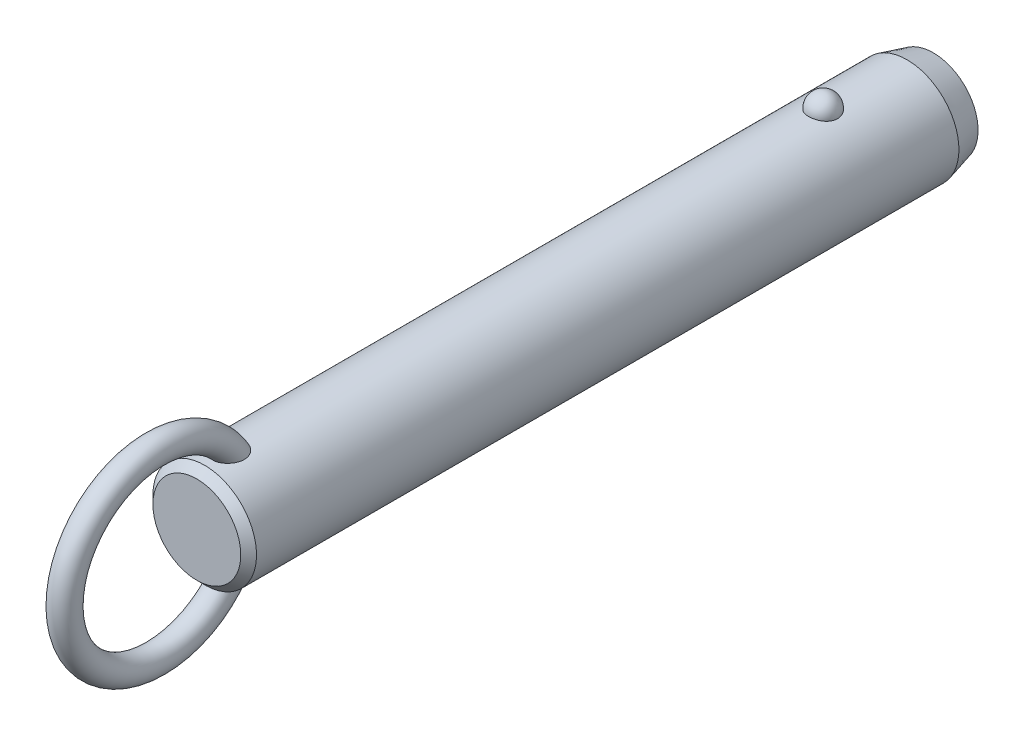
ISO-10303-21;
HEADER;
FILE_DESCRIPTION(('STEP AP214'),'2;1');
FILE_NAME('part.step','',(''),(''),'','','');
FILE_SCHEMA(('AUTOMOTIVE_DESIGN { 1 0 10303 214 1 1 1 1 }'));
ENDSEC;
DATA;
#1=APPLICATION_CONTEXT('core data for automotive mechanical design processes');
#2=APPLICATION_PROTOCOL_DEFINITION('international standard','automotive_design',2000,#1);
#3=PRODUCT_CONTEXT('',#1,'mechanical');
#4=PRODUCT('Part','Part','',(#3));
#5=PRODUCT_RELATED_PRODUCT_CATEGORY('part','',(#4));
#6=PRODUCT_DEFINITION_FORMATION('','',#4);
#7=PRODUCT_DEFINITION_CONTEXT('part definition',#1,'design');
#8=PRODUCT_DEFINITION('design','',#6,#7);
#9=PRODUCT_DEFINITION_SHAPE('','',#8);
#10=(LENGTH_UNIT() NAMED_UNIT(*) SI_UNIT(.MILLI.,.METRE.));
#11=(NAMED_UNIT(*) PLANE_ANGLE_UNIT() SI_UNIT($,.RADIAN.));
#12=(NAMED_UNIT(*) SI_UNIT($,.STERADIAN.) SOLID_ANGLE_UNIT());
#13=UNCERTAINTY_MEASURE_WITH_UNIT(LENGTH_MEASURE(1.E-05),#10,'distance_accuracy_value','');
#14=(GEOMETRIC_REPRESENTATION_CONTEXT(3) GLOBAL_UNCERTAINTY_ASSIGNED_CONTEXT((#13)) GLOBAL_UNIT_ASSIGNED_CONTEXT((#10,
#11,#12)) REPRESENTATION_CONTEXT('',''));
#15=CARTESIAN_POINT('',(0.,0.,0.));
#16=DIRECTION('',(0.,0.,1.));
#17=DIRECTION('',(1.,0.,0.));
#18=AXIS2_PLACEMENT_3D('',#15,#16,#17);
#19=CARTESIAN_POINT('',(0.,0.,83.8));
#20=DIRECTION('',(0.,0.,-1.));
#21=DIRECTION('',(-1.,0.,0.));
#22=AXIS2_PLACEMENT_3D('',#19,#20,#21);
#23=CYLINDRICAL_SURFACE('',#22,7.9);
#24=CARTESIAN_POINT('',(2.1785689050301,7.59367088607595,-2.19999999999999));
#25=CARTESIAN_POINT('',(2.17856679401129,7.59367269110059,-2.07701843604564));
#26=CARTESIAN_POINT('',(2.16853481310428,7.59657145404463,-1.95401006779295));
#27=CARTESIAN_POINT('',(2.12864689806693,7.607843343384,-1.71147811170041));
#28=CARTESIAN_POINT('',(2.09878338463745,7.61621856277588,-1.59195587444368));
#29=CARTESIAN_POINT('',(2.0199931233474,7.63749180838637,-1.3598563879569));
#30=CARTESIAN_POINT('',(1.97107475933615,7.6503878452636,-1.24727610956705));
#31=CARTESIAN_POINT('',(1.85539377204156,7.67926115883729,-1.03213234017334));
#32=CARTESIAN_POINT('',(1.78863158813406,7.69523835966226,-0.929568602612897));
#33=CARTESIAN_POINT('',(1.63856494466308,7.7285848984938,-0.736786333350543));
#34=CARTESIAN_POINT('',(1.55518140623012,7.7459606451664,-0.646630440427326));
#35=CARTESIAN_POINT('',(1.37422937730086,7.78009978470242,-0.481747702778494));
#36=CARTESIAN_POINT('',(1.27666086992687,7.79686317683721,-0.407020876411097));
#37=CARTESIAN_POINT('',(1.07024728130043,7.82786153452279,-0.275278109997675));
#38=CARTESIAN_POINT('',(0.961434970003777,7.84210353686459,-0.218212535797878));
#39=CARTESIAN_POINT('',(0.735351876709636,7.86652194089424,-0.123146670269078));
#40=CARTESIAN_POINT('',(0.618082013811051,7.87669878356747,-0.085144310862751));
#41=CARTESIAN_POINT('',(0.380637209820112,7.89170521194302,-0.0298158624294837));
#42=CARTESIAN_POINT('',(0.260550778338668,7.89662650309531,-0.0121347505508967));
#43=CARTESIAN_POINT('',(0.0190117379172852,7.90090003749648,0.00324379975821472));
#44=CARTESIAN_POINT('',(-0.102440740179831,7.90025280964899,0.00094313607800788));
#45=CARTESIAN_POINT('',(-0.341452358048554,7.89351056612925,-0.0233955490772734));
#46=CARTESIAN_POINT('',(-0.459042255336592,7.88749257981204,-0.0451545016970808));
#47=CARTESIAN_POINT('',(-0.688796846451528,7.87075812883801,-0.107408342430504));
#48=CARTESIAN_POINT('',(-0.800961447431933,7.86004158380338,-0.147903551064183));
#49=CARTESIAN_POINT('',(-1.01743634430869,7.83497131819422,-0.246799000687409));
#50=CARTESIAN_POINT('',(-1.12169791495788,7.82059709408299,-0.305300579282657));
#51=CARTESIAN_POINT('',(-1.31891765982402,7.78976470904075,-0.438549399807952));
#52=CARTESIAN_POINT('',(-1.41187469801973,7.77330633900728,-0.513298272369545));
#53=CARTESIAN_POINT('',(-1.58577142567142,7.73972434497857,-0.678622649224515));
#54=CARTESIAN_POINT('',(-1.66645140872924,7.72259402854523,-0.769470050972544));
#55=CARTESIAN_POINT('',(-1.81161503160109,7.68983776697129,-0.963538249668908));
#56=CARTESIAN_POINT('',(-1.87609753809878,7.6742119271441,-1.06675991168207));
#57=CARTESIAN_POINT('',(-1.98790138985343,7.6460202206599,-1.28401170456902));
#58=CARTESIAN_POINT('',(-2.03501994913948,7.63349104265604,-1.39815107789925));
#59=CARTESIAN_POINT('',(-2.10986724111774,7.6131449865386,-1.63301784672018));
#60=CARTESIAN_POINT('',(-2.1375965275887,7.60532797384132,-1.75374505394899));
#61=CARTESIAN_POINT('',(-2.17289256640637,7.5953195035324,-1.99782562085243));
#62=CARTESIAN_POINT('',(-2.18054294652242,7.59310471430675,-2.12116592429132));
#63=CARTESIAN_POINT('',(-2.17572919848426,7.59448538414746,-2.36741799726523));
#64=CARTESIAN_POINT('',(-2.1632656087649,7.59808068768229,-2.49032977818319));
#65=CARTESIAN_POINT('',(-2.11865035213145,7.61064035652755,-2.73161015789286));
#66=CARTESIAN_POINT('',(-2.08659579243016,7.61957823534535,-2.84999812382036));
#67=CARTESIAN_POINT('',(-2.00367799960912,7.64179982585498,-3.07955956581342));
#68=CARTESIAN_POINT('',(-1.9528140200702,7.65508371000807,-3.19073275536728));
#69=CARTESIAN_POINT('',(-1.83321113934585,7.68460381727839,-3.40337899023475));
#70=CARTESIAN_POINT('',(-1.76437735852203,7.70085556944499,-3.50479651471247));
#71=CARTESIAN_POINT('',(-1.61069526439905,7.73445734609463,-3.69446912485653));
#72=CARTESIAN_POINT('',(-1.52584634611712,7.75180741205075,-3.78272371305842));
#73=CARTESIAN_POINT('',(-1.34198059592,7.78574608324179,-3.94393987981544));
#74=CARTESIAN_POINT('',(-1.24291308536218,7.80233167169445,-4.01684434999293));
#75=CARTESIAN_POINT('',(-1.03352039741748,7.83281625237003,-4.14489386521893));
#76=CARTESIAN_POINT('',(-0.92319600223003,7.84671543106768,-4.20004014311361));
#77=CARTESIAN_POINT('',(-0.695822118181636,7.87011575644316,-4.29042017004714));
#78=CARTESIAN_POINT('',(-0.578872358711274,7.87966903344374,-4.32589112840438));
#79=CARTESIAN_POINT('',(-0.340410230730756,7.8935652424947,-4.37692226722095));
#80=CARTESIAN_POINT('',(-0.218898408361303,7.89790879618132,-4.39248482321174));
#81=CARTESIAN_POINT('',(0.0228107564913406,7.90087453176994,-4.40314405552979));
#82=CARTESIAN_POINT('',(0.142990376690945,7.89960185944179,-4.39861683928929));
#83=CARTESIAN_POINT('',(0.380829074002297,7.89171262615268,-4.37008293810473));
#84=CARTESIAN_POINT('',(0.498488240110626,7.8850962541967,-4.34607694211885));
#85=CARTESIAN_POINT('',(0.727535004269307,7.86726442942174,-4.27939317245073));
#86=CARTESIAN_POINT('',(0.838944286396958,7.85606616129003,-4.236785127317));
#87=CARTESIAN_POINT('',(1.05295421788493,7.83025654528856,-4.13408348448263));
#88=CARTESIAN_POINT('',(1.15555431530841,7.81564498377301,-4.07398879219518));
#89=CARTESIAN_POINT('',(1.35076763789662,7.7843022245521,-3.93687432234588));
#90=CARTESIAN_POINT('',(1.4432046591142,7.76754209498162,-3.85961036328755));
#91=CARTESIAN_POINT('',(1.6139111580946,7.73387857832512,-3.69076949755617));
#92=CARTESIAN_POINT('',(1.6921781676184,7.71697516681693,-3.59919010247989));
#93=CARTESIAN_POINT('',(1.83380875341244,7.6845643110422,-3.40247278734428));
#94=CARTESIAN_POINT('',(1.89689280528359,7.66908588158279,-3.29712873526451));
#95=CARTESIAN_POINT('',(2.0047823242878,7.64159441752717,-3.07707931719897));
#96=CARTESIAN_POINT('',(2.0495945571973,7.62958010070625,-2.96237743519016));
#97=CARTESIAN_POINT('',(2.11580183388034,7.61146617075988,-2.74040519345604));
#98=CARTESIAN_POINT('',(2.13929812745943,7.60484503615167,-2.63379846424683));
#99=CARTESIAN_POINT('',(2.17068242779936,7.59594664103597,-2.41813481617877));
#100=CARTESIAN_POINT('',(2.17857077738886,7.59366928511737,-2.30907795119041));
#101=CARTESIAN_POINT('',(2.1785689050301,7.59367088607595,-2.19999999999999));
#102=B_SPLINE_CURVE_WITH_KNOTS('',3,(#24,#25,#26,#27,#28,#29,#30,#31,#32,#33,#34,#35,#36,#37,
#38,#39,#40,#41,#42,#43,#44,#45,#46,#47,#48,#49,#50,#51,#52,#53,#54,#55,#56,#57,#58,#59,#60,#61,
#62,#63,#64,#65,#66,#67,#68,#69,#70,#71,#72,#73,#74,#75,#76,#77,#78,#79,#80,#81,#82,#83,#84,#85,
#86,#87,#88,#89,#90,#91,#92,#93,#94,#95,#96,#97,#98,#99,#100,#101),.UNSPECIFIED.,.T.,.F.,(4,2,2,
2,2,2,2,2,2,2,2,2,2,2,2,2,2,2,2,2,2,2,2,2,2,2,2,2,2,2,2,2,2,2,2,2,2,2,4),(0.,0.368552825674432,
0.737246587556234,1.10577831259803,1.4743009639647,1.8446206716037,2.21494081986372,
2.5842105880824,2.95344028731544,3.31611630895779,3.67875788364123,4.03628044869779,
4.39380913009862,4.75338791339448,5.11300280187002,5.47939989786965,5.8458226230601,
6.21639834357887,6.58696347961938,6.95598276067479,7.32499216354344,7.69218715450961,
8.0593967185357,8.42858578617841,8.79778880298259,9.16834203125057,9.5388695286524,
9.90482699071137,10.2707407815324,10.6298333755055,10.9889132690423,11.3466585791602,
11.7044262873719,12.0676511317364,12.4309391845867,12.8004764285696,13.1698767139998,
13.4967701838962,13.8236564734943),.UNSPECIFIED.);
#103=CARTESIAN_POINT('',(2.1785689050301,7.59367088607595,-2.19999999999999));
#104=VERTEX_POINT('',#103);
#105=EDGE_CURVE('E41',#104,#104,#102,.T.);
#106=ORIENTED_EDGE('',*,*,#105,.T.);
#107=EDGE_LOOP('',(#106));
#108=FACE_BOUND('',#107,.T.);
#109=CARTESIAN_POINT('',(0.,0.,92.12));
#110=DIRECTION('',(0.,0.,1.));
#111=DIRECTION('',(1.,0.,0.));
#112=AXIS2_PLACEMENT_3D('',#109,#110,#111);
#113=CIRCLE('',#112,7.9);
#114=CARTESIAN_POINT('',(-7.90000000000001,0.,92.12));
#115=VERTEX_POINT('',#114);
#116=EDGE_CURVE('E10',#115,#115,#113,.F.);
#117=ORIENTED_EDGE('',*,*,#116,.T.);
#118=EDGE_LOOP('',(#117));
#119=FACE_BOUND('',#118,.T.);
#120=CARTESIAN_POINT('',(-0.630969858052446,-7.87476203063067,86.0124322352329));
#121=CARTESIAN_POINT('',(-0.734180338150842,-7.8664899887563,86.047285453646));
#122=CARTESIAN_POINT('',(-0.834476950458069,-7.85639291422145,86.0908160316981));
#123=CARTESIAN_POINT('',(-1.0262035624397,-7.83366343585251,86.194094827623));
#124=CARTESIAN_POINT('',(-1.1176141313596,-7.82102565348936,86.2538775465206));
#125=CARTESIAN_POINT('',(-1.28877277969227,-7.79464922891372,86.3878390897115));
#126=CARTESIAN_POINT('',(-1.36854014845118,-7.78091246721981,86.461993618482));
#127=CARTESIAN_POINT('',(-1.5146152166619,-7.75380398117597,86.6224941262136));
#128=CARTESIAN_POINT('',(-1.58092966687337,-7.74043207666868,86.7088339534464));
#129=CARTESIAN_POINT('',(-1.70019064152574,-7.71512522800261,86.8929784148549));
#130=CARTESIAN_POINT('',(-1.75284037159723,-7.70322473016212,86.9909792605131));
#131=CARTESIAN_POINT('',(-1.84263464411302,-7.68224112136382,87.1941029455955));
#132=CARTESIAN_POINT('',(-1.87977299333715,-7.6731591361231,87.2992286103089));
#133=CARTESIAN_POINT('',(-1.94152728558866,-7.65777930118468,87.5232849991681));
#134=CARTESIAN_POINT('',(-1.96475471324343,-7.65179654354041,87.6426167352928));
#135=CARTESIAN_POINT('',(-1.99449499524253,-7.64409642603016,87.8834298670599));
#136=CARTESIAN_POINT('',(-2.0010005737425,-7.64238092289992,88.0049121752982));
#137=CARTESIAN_POINT('',(-1.99856014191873,-7.64302120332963,88.2683409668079));
#138=CARTESIAN_POINT('',(-1.98680021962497,-7.64611845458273,88.4102565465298));
#139=CARTESIAN_POINT('',(-1.94457772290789,-7.65696186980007,88.6911188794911));
#140=CARTESIAN_POINT('',(-1.91409393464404,-7.66471330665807,88.8300620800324));
#141=CARTESIAN_POINT('',(-1.82768670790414,-7.68582947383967,89.1319397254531));
#142=CARTESIAN_POINT('',(-1.76772963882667,-7.70003779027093,89.293686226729));
#143=CARTESIAN_POINT('',(-1.65998501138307,-7.72371550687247,89.5276956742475));
#144=CARTESIAN_POINT('',(-1.621079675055,-7.73200670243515,89.6042974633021));
#145=CARTESIAN_POINT('',(-1.53727726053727,-7.74910377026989,89.7540798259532));
#146=CARTESIAN_POINT('',(-1.49238215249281,-7.75790947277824,89.8272615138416));
#147=CARTESIAN_POINT('',(-1.3739705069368,-7.77993338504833,90.0028838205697));
#148=CARTESIAN_POINT('',(-1.29690364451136,-7.79328473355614,90.1029557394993));
#149=CARTESIAN_POINT('',(-1.12885487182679,-7.81939266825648,90.2907147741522));
#150=CARTESIAN_POINT('',(-1.03789926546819,-7.83215032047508,90.3784247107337));
#151=CARTESIAN_POINT('',(-0.869532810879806,-7.85231710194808,90.5134148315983));
#152=CARTESIAN_POINT('',(-0.795716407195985,-7.86021093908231,90.565076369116));
#153=CARTESIAN_POINT('',(-0.64081313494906,-7.87434920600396,90.6563815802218));
#154=CARTESIAN_POINT('',(-0.55973779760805,-7.88059619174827,90.6960438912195));
#155=CARTESIAN_POINT('',(-0.406456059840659,-7.88984116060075,90.7543008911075));
#156=CARTESIAN_POINT('',(-0.335227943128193,-7.89321892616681,90.7753848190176));
#157=CARTESIAN_POINT('',(-0.190193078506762,-7.89804235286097,90.8054141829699));
#158=CARTESIAN_POINT('',(-0.116388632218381,-7.89948969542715,90.8143701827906));
#159=CARTESIAN_POINT('',(0.0318414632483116,-7.90028409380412,90.8192915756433));
#160=CARTESIAN_POINT('',(0.10626813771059,-7.89962640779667,90.8152276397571));
#161=CARTESIAN_POINT('',(0.253290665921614,-7.8962818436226,90.7944615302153));
#162=CARTESIAN_POINT('',(0.32588518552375,-7.8935935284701,90.7777504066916));
#163=CARTESIAN_POINT('',(0.481441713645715,-7.88577340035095,90.7287380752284));
#164=CARTESIAN_POINT('',(0.563611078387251,-7.88026321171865,90.694005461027));
#165=CARTESIAN_POINT('',(0.721129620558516,-7.86741729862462,90.6117965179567));
#166=CARTESIAN_POINT('',(0.796466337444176,-7.86007832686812,90.5642975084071));
#167=CARTESIAN_POINT('',(0.971456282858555,-7.84073285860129,90.436513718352));
#168=CARTESIAN_POINT('',(1.06719686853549,-7.82809461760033,90.3510047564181));
#169=CARTESIAN_POINT('',(1.24418921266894,-7.80192439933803,90.166232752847));
#170=CARTESIAN_POINT('',(1.32540832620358,-7.78839049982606,90.0669395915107));
#171=CARTESIAN_POINT('',(1.45199971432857,-7.76559693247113,89.8895760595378));
#172=CARTESIAN_POINT('',(1.5008564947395,-7.75626094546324,89.8139542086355));
#173=CARTESIAN_POINT('',(1.59197749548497,-7.7380727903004,89.6587428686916));
#174=CARTESIAN_POINT('',(1.63423919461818,-7.72922080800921,89.5791518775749));
#175=CARTESIAN_POINT('',(1.71222612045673,-7.71231959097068,89.4166640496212));
#176=CARTESIAN_POINT('',(1.74794516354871,-7.70427111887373,89.3337641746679));
#177=CARTESIAN_POINT('',(1.81270113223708,-7.68929240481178,89.1652967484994));
#178=CARTESIAN_POINT('',(1.84173789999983,-7.68236218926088,89.0797291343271));
#179=CARTESIAN_POINT('',(1.89322698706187,-7.66983757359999,88.9052870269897));
#180=CARTESIAN_POINT('',(1.91558744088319,-7.66426199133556,88.8163838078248));
#181=CARTESIAN_POINT('',(1.95281367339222,-7.65485915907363,88.6369696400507));
#182=CARTESIAN_POINT('',(1.96767946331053,-7.65103190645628,88.5464586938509));
#183=CARTESIAN_POINT('',(2.00021456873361,-7.64262981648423,88.2737320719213));
#184=CARTESIAN_POINT('',(2.00600691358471,-7.6410871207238,88.0897099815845));
#185=CARTESIAN_POINT('',(1.98445334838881,-7.64669564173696,87.7765019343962));
#186=CARTESIAN_POINT('',(1.96607186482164,-7.65149688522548,87.6466189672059));
#187=CARTESIAN_POINT('',(1.90884967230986,-7.6659762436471,87.3916321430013));
#188=CARTESIAN_POINT('',(1.8700210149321,-7.67565148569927,87.266525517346));
#189=CARTESIAN_POINT('',(1.77063986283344,-7.69918471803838,87.0245401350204));
#190=CARTESIAN_POINT('',(1.70993724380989,-7.71307150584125,86.9077250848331));
#191=CARTESIAN_POINT('',(1.56733070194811,-7.74330306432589,86.6881444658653));
#192=CARTESIAN_POINT('',(1.4854369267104,-7.75964665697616,86.5853722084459));
#193=CARTESIAN_POINT('',(1.31346177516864,-7.79047523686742,86.4093800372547));
#194=CARTESIAN_POINT('',(1.22547278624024,-7.80495298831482,86.3341066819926));
#195=CARTESIAN_POINT('',(1.03724352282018,-7.83218597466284,86.2004864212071));
#196=CARTESIAN_POINT('',(0.937008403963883,-7.84494192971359,86.1421324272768));
#197=CARTESIAN_POINT('',(0.733599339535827,-7.86649045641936,86.0470270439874));
#198=CARTESIAN_POINT('',(0.630941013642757,-7.87547134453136,86.0092109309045));
#199=CARTESIAN_POINT('',(0.420465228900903,-7.88950708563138,85.9511160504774));
#200=CARTESIAN_POINT('',(0.312645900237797,-7.89456050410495,85.9308436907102));
#201=CARTESIAN_POINT('',(0.0960869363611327,-7.9001518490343,85.9084559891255));
#202=CARTESIAN_POINT('',(-0.0126341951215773,-7.90073226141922,85.9061698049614));
#203=CARTESIAN_POINT('',(-0.228766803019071,-7.89742350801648,85.9193678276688));
#204=CARTESIAN_POINT('',(-0.336180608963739,-7.89354403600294,85.9348134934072));
#205=CARTESIAN_POINT('',(-0.473410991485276,-7.88586871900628,85.9662177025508));
#206=CARTESIAN_POINT('',(-0.50525779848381,-7.88388984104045,85.9743541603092));
#207=CARTESIAN_POINT('',(-0.5684812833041,-7.87958326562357,85.9922083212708));
#208=CARTESIAN_POINT('',(-0.599857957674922,-7.87725556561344,86.0019260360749));
#209=CARTESIAN_POINT('',(-0.630969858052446,-7.87476203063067,86.0124322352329));
#210=B_SPLINE_CURVE_WITH_KNOTS('',3,(#120,#121,#122,#123,#124,#125,#126,#127,#128,#129,#130,
#131,#132,#133,#134,#135,#136,#137,#138,#139,#140,#141,#142,#143,#144,#145,#146,#147,#148,#149,
#150,#151,#152,#153,#154,#155,#156,#157,#158,#159,#160,#161,#162,#163,#164,#165,#166,#167,#168,
#169,#170,#171,#172,#173,#174,#175,#176,#177,#178,#179,#180,#181,#182,#183,#184,#185,#186,#187,
#188,#189,#190,#191,#192,#193,#194,#195,#196,#197,#198,#199,#200,#201,#202,#203,#204,#205,#206,
#207,#208,#209),.UNSPECIFIED.,.T.,.F.,(4,2,2,2,2,2,2,2,2,2,2,2,2,2,2,2,2,2,2,2,2,2,2,2,2,2,2,2,
2,2,2,2,2,2,2,2,2,2,2,2,2,2,2,2,4),(0.,0.327622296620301,0.655945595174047,0.983718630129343,
1.3113267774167,1.64554655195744,1.9798996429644,2.34365728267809,2.70757317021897,
3.13333684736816,3.55958380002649,4.07655306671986,4.33527897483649,4.59391999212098,
4.9738243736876,5.35301797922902,5.62348245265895,5.89352465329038,6.11565959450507,
6.33760092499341,6.56004255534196,6.78264174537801,7.04930844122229,7.31645206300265,
7.70130871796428,8.08701995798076,8.35824509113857,8.62957365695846,8.90115735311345,
9.17274746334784,9.44791855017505,9.72308922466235,10.2715298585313,10.6638393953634,
11.0559179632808,11.4507403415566,11.845374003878,12.1936425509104,12.5417649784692,
12.8695063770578,13.1973674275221,13.5221104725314,13.8461490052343,13.9449071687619,
14.0436660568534),.UNSPECIFIED.);
#211=CARTESIAN_POINT('',(-0.630969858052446,-7.87476203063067,86.0124322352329));
#212=VERTEX_POINT('',#211);
#213=EDGE_CURVE('E60',#212,#212,#210,.T.);
#214=ORIENTED_EDGE('',*,*,#213,.T.);
#215=EDGE_LOOP('',(#214));
#216=FACE_BOUND('',#215,.T.);
#217=CARTESIAN_POINT('',(-0.630969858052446,7.87476203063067,86.0124322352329));
#218=CARTESIAN_POINT('',(-0.52891882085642,7.88293636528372,85.9779798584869));
#219=CARTESIAN_POINT('',(-0.423745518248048,7.8893481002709,85.951915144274));
#220=CARTESIAN_POINT('',(-0.210236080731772,7.8979273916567,85.9172825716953));
#221=CARTESIAN_POINT('',(-0.10189380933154,7.90008607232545,85.9087513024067));
#222=CARTESIAN_POINT('',(0.114660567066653,7.89990877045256,85.9094570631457));
#223=CARTESIAN_POINT('',(0.222872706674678,7.89757640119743,85.9186798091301));
#224=CARTESIAN_POINT('',(0.436107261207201,7.88867538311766,85.9546525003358));
#225=CARTESIAN_POINT('',(0.541131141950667,7.8821087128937,85.9813942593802));
#226=CARTESIAN_POINT('',(0.745085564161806,7.86545130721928,86.0517561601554));
#227=CARTESIAN_POINT('',(0.844015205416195,7.85536005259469,86.0953787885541));
#228=CARTESIAN_POINT('',(1.03299167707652,7.83275153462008,86.1983796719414));
#229=CARTESIAN_POINT('',(1.12303841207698,7.8202342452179,86.2577580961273));
#230=CARTESIAN_POINT('',(1.29214734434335,7.79408219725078,86.3908647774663));
#231=CARTESIAN_POINT('',(1.37116907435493,7.78044359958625,86.4646436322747));
#232=CARTESIAN_POINT('',(1.51597677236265,7.75353170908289,86.6242353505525));
#233=CARTESIAN_POINT('',(1.58176261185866,7.74025841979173,86.7100483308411));
#234=CARTESIAN_POINT('',(1.70057386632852,7.71504069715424,86.893644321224));
#235=CARTESIAN_POINT('',(1.75320073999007,7.7031425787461,86.9916906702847));
#236=CARTESIAN_POINT('',(1.8429376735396,7.68216822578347,87.1948931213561));
#237=CARTESIAN_POINT('',(1.88004278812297,7.67309289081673,87.3000514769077));
#238=CARTESIAN_POINT('',(1.9417232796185,7.6577294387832,87.5241671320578));
#239=CARTESIAN_POINT('',(1.96491037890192,7.65175648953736,87.6435248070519));
#240=CARTESIAN_POINT('',(1.9945689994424,7.64407702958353,87.8843848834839));
#241=CARTESIAN_POINT('',(2.00103304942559,7.64237242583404,88.0058882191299));
#242=CARTESIAN_POINT('',(1.9985016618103,7.64303650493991,88.2693688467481));
#243=CARTESIAN_POINT('',(1.98669038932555,7.64614714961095,88.4113141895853));
#244=CARTESIAN_POINT('',(1.94436120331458,7.6570170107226,88.6922287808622));
#245=CARTESIAN_POINT('',(1.91382203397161,7.66478150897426,88.8311944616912));
#246=CARTESIAN_POINT('',(1.82728754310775,7.68592483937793,89.1331110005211));
#247=CARTESIAN_POINT('',(1.76725778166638,7.70014685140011,89.294872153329));
#248=CARTESIAN_POINT('',(1.65939700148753,7.72384204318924,89.5288914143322));
#249=CARTESIAN_POINT('',(1.62045187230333,7.73213852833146,89.6054942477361));
#250=CARTESIAN_POINT('',(1.5365668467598,7.74924489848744,89.7552737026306));
#251=CARTESIAN_POINT('',(1.49162892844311,7.75805461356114,89.8284514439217));
#252=CARTESIAN_POINT('',(1.37317698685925,7.78007342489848,90.0039520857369));
#253=CARTESIAN_POINT('',(1.29612360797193,7.79341423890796,90.1039112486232));
#254=CARTESIAN_POINT('',(1.12812043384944,7.81949839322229,90.2914508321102));
#255=CARTESIAN_POINT('',(1.03719688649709,7.83224280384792,90.3790540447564));
#256=CARTESIAN_POINT('',(0.868871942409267,7.85239026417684,90.5138971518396));
#257=CARTESIAN_POINT('',(0.795056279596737,7.86027769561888,90.5655113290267));
#258=CARTESIAN_POINT('',(0.640160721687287,7.87440222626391,90.6567201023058));
#259=CARTESIAN_POINT('',(0.559092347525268,7.88064188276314,90.6963333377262));
#260=CARTESIAN_POINT('',(0.405820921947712,7.8898738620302,90.7545056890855));
#261=CARTESIAN_POINT('',(0.33459413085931,7.89324577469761,90.7755523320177));
#262=CARTESIAN_POINT('',(0.189568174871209,7.89805733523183,90.8055070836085));
#263=CARTESIAN_POINT('',(0.115771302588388,7.89949866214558,90.8144257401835));
#264=CARTESIAN_POINT('',(-0.0324359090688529,7.90028156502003,90.8192758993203));
#265=CARTESIAN_POINT('',(-0.106847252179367,7.89961843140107,90.8151782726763));
#266=CARTESIAN_POINT('',(-0.253834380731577,7.8962642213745,90.7943519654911));
#267=CARTESIAN_POINT('',(-0.326408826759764,7.89357170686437,90.7776143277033));
#268=CARTESIAN_POINT('',(-0.481962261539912,7.88574179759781,90.7285391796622));
#269=CARTESIAN_POINT('',(-0.564145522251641,7.88022507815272,90.6937638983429));
#270=CARTESIAN_POINT('',(-0.721685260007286,7.86736646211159,90.6114686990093));
#271=CARTESIAN_POINT('',(-0.797029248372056,7.8600213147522,90.5639260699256));
#272=CARTESIAN_POINT('',(-0.972044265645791,7.84066026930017,90.4360267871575));
#273=CARTESIAN_POINT('',(-1.06779803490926,7.82801274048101,90.3504436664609));
#274=CARTESIAN_POINT('',(-1.24480531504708,7.80182621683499,90.1655223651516));
#275=CARTESIAN_POINT('',(-1.32602618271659,7.78828530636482,90.0661540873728));
#276=CARTESIAN_POINT('',(-1.45259834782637,7.76548487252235,89.8886806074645));
#277=CARTESIAN_POINT('',(-1.50143856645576,7.75614818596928,89.8130252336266));
#278=CARTESIAN_POINT('',(-1.59252410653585,7.73796020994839,89.6577484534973));
#279=CARTESIAN_POINT('',(-1.63476690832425,7.72910910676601,89.5781255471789));
#280=CARTESIAN_POINT('',(-1.71271318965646,7.71221133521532,89.4155750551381));
#281=CARTESIAN_POINT('',(-1.74841047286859,7.70416543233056,89.3326444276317));
#282=CARTESIAN_POINT('',(-1.81311929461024,7.6891937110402,89.1641168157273));
#283=CARTESIAN_POINT('',(-1.84213067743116,7.6822679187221,89.0785197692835));
#284=CARTESIAN_POINT('',(-1.89356259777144,7.66975461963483,88.9040254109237));
#285=CARTESIAN_POINT('',(-1.91589165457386,7.66418586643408,88.8150995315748));
#286=CARTESIAN_POINT('',(-1.95305070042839,7.65479859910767,88.6356424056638));
#287=CARTESIAN_POINT('',(-1.96788069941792,7.65098008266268,88.5451111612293));
#288=CARTESIAN_POINT('',(-2.00030078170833,7.64260704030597,88.2723270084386));
#289=CARTESIAN_POINT('',(-2.00600576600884,7.64108760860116,88.0882718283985));
#290=CARTESIAN_POINT('',(-1.98428483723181,7.64673945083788,87.7750800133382));
#291=CARTESIAN_POINT('',(-1.96583698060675,7.6515575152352,87.6452400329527));
#292=CARTESIAN_POINT('',(-1.90848948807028,7.66606613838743,87.3903619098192));
#293=CARTESIAN_POINT('',(-1.86960376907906,7.67575338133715,87.265320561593));
#294=CARTESIAN_POINT('',(-1.7701342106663,7.6993013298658,87.0235009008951));
#295=CARTESIAN_POINT('',(-1.70940488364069,7.71318991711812,86.9067844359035));
#296=CARTESIAN_POINT('',(-1.56672953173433,7.74342495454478,86.6873404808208));
#297=CARTESIAN_POINT('',(-1.48478316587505,7.75977144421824,86.5846132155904));
#298=CARTESIAN_POINT('',(-1.31266325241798,7.79061163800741,86.4086431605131));
#299=CARTESIAN_POINT('',(-1.22456383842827,7.80509908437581,86.3333589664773));
#300=CARTESIAN_POINT('',(-1.03622400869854,7.83231881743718,86.1998659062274));
#301=CARTESIAN_POINT('',(-0.936015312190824,7.84505551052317,86.1416137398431));
#302=CARTESIAN_POINT('',(-0.798824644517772,7.85957802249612,86.0775408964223));
#303=CARTESIAN_POINT('',(-0.765787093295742,7.86286821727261,86.0632248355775));
#304=CARTESIAN_POINT('',(-0.698939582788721,7.86909211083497,86.036436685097));
#305=CARTESIAN_POINT('',(-0.665129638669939,7.8720258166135,86.0239645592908));
#306=CARTESIAN_POINT('',(-0.630969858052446,7.87476203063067,86.0124322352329));
#307=B_SPLINE_CURVE_WITH_KNOTS('',3,(#217,#218,#219,#220,#221,#222,#223,#224,#225,#226,#227,
#228,#229,#230,#231,#232,#233,#234,#235,#236,#237,#238,#239,#240,#241,#242,#243,#244,#245,#246,
#247,#248,#249,#250,#251,#252,#253,#254,#255,#256,#257,#258,#259,#260,#261,#262,#263,#264,#265,
#266,#267,#268,#269,#270,#271,#272,#273,#274,#275,#276,#277,#278,#279,#280,#281,#282,#283,#284,
#285,#286,#287,#288,#289,#290,#291,#292,#293,#294,#295,#296,#297,#298,#299,#300,#301,#302,#303,
#304,#305,#306),.UNSPECIFIED.,.T.,.F.,(4,2,2,2,2,2,2,2,2,2,2,2,2,2,2,2,2,2,2,2,2,2,2,2,2,2,2,2,
2,2,2,2,2,2,2,2,2,2,2,2,2,2,2,2,4),(0.,0.323920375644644,0.648516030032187,0.97285063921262,
1.29703380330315,1.62126473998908,1.94549915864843,2.27089401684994,2.5962920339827,
2.93059633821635,3.26500707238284,3.62881644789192,3.99278833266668,4.41865421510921,
4.84500434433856,5.36209210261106,5.62087589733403,5.87957448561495,6.25918598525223,
6.63808782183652,6.90846748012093,7.17842501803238,7.40052350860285,7.62242871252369,
7.84483086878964,8.06739077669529,8.33414615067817,8.60137921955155,8.98641454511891,
9.3723041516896,9.6435867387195,9.91497268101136,10.1866142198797,10.4582620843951,
10.7334745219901,11.0086865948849,11.5572126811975,11.9494246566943,12.3413699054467,
12.7359755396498,13.1305875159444,13.4791770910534,13.82687259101,13.9353013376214,
14.0437279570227),.UNSPECIFIED.);
#308=CARTESIAN_POINT('',(-0.630969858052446,7.87476203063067,86.0124322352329));
#309=VERTEX_POINT('',#308);
#310=EDGE_CURVE('E68',#309,#309,#307,.T.);
#311=ORIENTED_EDGE('',*,*,#310,.T.);
#312=EDGE_LOOP('',(#311));
#313=FACE_BOUND('',#312,.T.);
#314=CARTESIAN_POINT('',(0.,0.,-15.));
#315=DIRECTION('',(0.,0.,-1.));
#316=DIRECTION('',(-1.,0.,0.));
#317=AXIS2_PLACEMENT_3D('',#314,#315,#316);
#318=CIRCLE('',#317,7.9);
#319=CARTESIAN_POINT('',(-7.9,0.,-15.));
#320=VERTEX_POINT('',#319);
#321=EDGE_CURVE('E57',#320,#320,#318,.F.);
#322=ORIENTED_EDGE('',*,*,#321,.T.);
#323=EDGE_LOOP('',(#322));
#324=FACE_BOUND('',#323,.T.);
#325=ADVANCED_FACE('F37',(#108,#119,#216,#313,#324),#23,.T.);
#326=CARTESIAN_POINT('',(0.,0.,-19.));
#327=DIRECTION('',(0.,0.,-1.));
#328=DIRECTION('',(-1.,0.,0.));
#329=AXIS2_PLACEMENT_3D('',#326,#327,#328);
#330=PLANE('',#329);
#331=CARTESIAN_POINT('',(0.,0.,-19.));
#332=DIRECTION('',(0.,0.,-1.));
#333=DIRECTION('',(-1.,0.,0.));
#334=AXIS2_PLACEMENT_3D('',#331,#332,#333);
#335=CIRCLE('',#334,6.82820323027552);
#336=CARTESIAN_POINT('',(-6.82820323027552,0.,-19.));
#337=VERTEX_POINT('',#336);
#338=EDGE_CURVE('E67',#337,#337,#335,.T.);
#339=ORIENTED_EDGE('',*,*,#338,.T.);
#340=EDGE_LOOP('',(#339));
#341=FACE_BOUND('',#340,.T.);
#342=ADVANCED_FACE('F86',(#341),#330,.T.);
#343=CARTESIAN_POINT('',(0.,0.,-19.));
#344=DIRECTION('',(0.,0.,1.));
#345=DIRECTION('',(1.,0.,0.));
#346=AXIS2_PLACEMENT_3D('',#343,#344,#345);
#347=CONICAL_SURFACE('',#346,6.82820323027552,0.261799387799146);
#348=ORIENTED_EDGE('',*,*,#321,.F.);
#349=EDGE_LOOP('',(#348));
#350=FACE_BOUND('',#349,.T.);
#351=ORIENTED_EDGE('',*,*,#338,.F.);
#352=EDGE_LOOP('',(#351));
#353=FACE_BOUND('',#352,.T.);
#354=ADVANCED_FACE('F84',(#350,#353),#347,.T.);
#355=CARTESIAN_POINT('',(0.,0.,93.32));
#356=DIRECTION('',(0.,0.,1.));
#357=DIRECTION('',(1.,0.,0.));
#358=AXIS2_PLACEMENT_3D('',#355,#356,#357);
#359=PLANE('',#358);
#360=CARTESIAN_POINT('',(0.,0.,93.32));
#361=DIRECTION('',(0.,0.,1.));
#362=DIRECTION('',(1.,0.,0.));
#363=AXIS2_PLACEMENT_3D('',#360,#361,#362);
#364=CIRCLE('',#363,6.69999999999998);
#365=CARTESIAN_POINT('',(-6.69999999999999,0.,93.32));
#366=VERTEX_POINT('',#365);
#367=EDGE_CURVE('E50',#366,#366,#364,.T.);
#368=ORIENTED_EDGE('',*,*,#367,.T.);
#369=EDGE_LOOP('',(#368));
#370=FACE_BOUND('',#369,.T.);
#371=ADVANCED_FACE('F78',(#370),#359,.T.);
#372=CARTESIAN_POINT('',(0.,0.,99.65));
#373=DIRECTION('',(1.,0.,0.));
#374=DIRECTION('',(0.,0.,-1.));
#375=AXIS2_PLACEMENT_3D('',#372,#373,#374);
#376=TOROIDAL_SURFACE('',#375,13.85,2.);
#377=ORIENTED_EDGE('',*,*,#310,.F.);
#378=EDGE_LOOP('',(#377));
#379=FACE_BOUND('',#378,.T.);
#380=ORIENTED_EDGE('',*,*,#213,.F.);
#381=EDGE_LOOP('',(#380));
#382=FACE_BOUND('',#381,.T.);
#383=ADVANCED_FACE('F74',(#379,#382),#376,.T.);
#384=CARTESIAN_POINT('',(0.,0.,93.32));
#385=DIRECTION('',(0.,0.,-1.));
#386=DIRECTION('',(-1.,0.,0.));
#387=AXIS2_PLACEMENT_3D('',#384,#385,#386);
#388=CONICAL_SURFACE('',#387,6.69999999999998,0.785398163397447);
#389=CARTESIAN_POINT('',(-7.90000000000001,0.,92.12));
#390=CARTESIAN_POINT('',(-7.88750000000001,0.,92.1325));
#391=CARTESIAN_POINT('',(-7.87500000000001,0.,92.145));
#392=CARTESIAN_POINT('',(-7.85000000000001,0.,92.17));
#393=CARTESIAN_POINT('',(-7.83750000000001,0.,92.1825));
#394=CARTESIAN_POINT('',(-7.81250000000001,0.,92.2075));
#395=CARTESIAN_POINT('',(-7.80000000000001,0.,92.22));
#396=CARTESIAN_POINT('',(-7.77500000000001,0.,92.245));
#397=CARTESIAN_POINT('',(-7.76250000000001,0.,92.2575));
#398=CARTESIAN_POINT('',(-7.73750000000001,0.,92.2825));
#399=CARTESIAN_POINT('',(-7.725,0.,92.295));
#400=CARTESIAN_POINT('',(-7.7,0.,92.32));
#401=CARTESIAN_POINT('',(-7.68750000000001,0.,92.3325));
#402=CARTESIAN_POINT('',(-7.66250000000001,0.,92.3575));
#403=CARTESIAN_POINT('',(-7.65000000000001,0.,92.37));
#404=CARTESIAN_POINT('',(-7.625,0.,92.395));
#405=CARTESIAN_POINT('',(-7.6125,0.,92.4075));
#406=CARTESIAN_POINT('',(-7.5875,0.,92.4325));
#407=CARTESIAN_POINT('',(-7.575,0.,92.445));
#408=CARTESIAN_POINT('',(-7.55,0.,92.47));
#409=CARTESIAN_POINT('',(-7.5375,0.,92.4825));
#410=CARTESIAN_POINT('',(-7.5125,0.,92.5075));
#411=CARTESIAN_POINT('',(-7.5,0.,92.52));
#412=CARTESIAN_POINT('',(-7.475,0.,92.545));
#413=CARTESIAN_POINT('',(-7.4625,0.,92.5575));
#414=CARTESIAN_POINT('',(-7.4375,0.,92.5825));
#415=CARTESIAN_POINT('',(-7.425,0.,92.595));
#416=CARTESIAN_POINT('',(-7.4,0.,92.62));
#417=CARTESIAN_POINT('',(-7.3875,0.,92.6325));
#418=CARTESIAN_POINT('',(-7.3625,0.,92.6575));
#419=CARTESIAN_POINT('',(-7.35,0.,92.67));
#420=CARTESIAN_POINT('',(-7.325,0.,92.695));
#421=CARTESIAN_POINT('',(-7.3125,0.,92.7075));
#422=CARTESIAN_POINT('',(-7.2875,0.,92.7325));
#423=CARTESIAN_POINT('',(-7.275,0.,92.745));
#424=CARTESIAN_POINT('',(-7.25,0.,92.77));
#425=CARTESIAN_POINT('',(-7.2375,0.,92.7825));
#426=CARTESIAN_POINT('',(-7.2125,0.,92.8075));
#427=CARTESIAN_POINT('',(-7.2,0.,92.82));
#428=CARTESIAN_POINT('',(-7.175,0.,92.845));
#429=CARTESIAN_POINT('',(-7.1625,0.,92.8575));
#430=CARTESIAN_POINT('',(-7.1375,0.,92.8825));
#431=CARTESIAN_POINT('',(-7.125,0.,92.895));
#432=CARTESIAN_POINT('',(-7.1,0.,92.92));
#433=CARTESIAN_POINT('',(-7.0875,0.,92.9325));
#434=CARTESIAN_POINT('',(-7.06249999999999,0.,92.9575));
#435=CARTESIAN_POINT('',(-7.04999999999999,0.,92.97));
#436=CARTESIAN_POINT('',(-7.02499999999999,0.,92.995));
#437=CARTESIAN_POINT('',(-7.0125,0.,93.0075));
#438=CARTESIAN_POINT('',(-6.9875,0.,93.0325));
#439=CARTESIAN_POINT('',(-6.975,0.,93.045));
#440=CARTESIAN_POINT('',(-6.94999999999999,0.,93.07));
#441=CARTESIAN_POINT('',(-6.93749999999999,0.,93.0825));
#442=CARTESIAN_POINT('',(-6.91249999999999,0.,93.1075));
#443=CARTESIAN_POINT('',(-6.9,0.,93.12));
#444=CARTESIAN_POINT('',(-6.87499999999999,0.,93.145));
#445=CARTESIAN_POINT('',(-6.86249999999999,0.,93.1575));
#446=CARTESIAN_POINT('',(-6.83749999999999,0.,93.1825));
#447=CARTESIAN_POINT('',(-6.82499999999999,0.,93.195));
#448=CARTESIAN_POINT('',(-6.79999999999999,0.,93.22));
#449=CARTESIAN_POINT('',(-6.78749999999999,0.,93.2325));
#450=CARTESIAN_POINT('',(-6.76249999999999,0.,93.2575));
#451=CARTESIAN_POINT('',(-6.74999999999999,0.,93.27));
#452=CARTESIAN_POINT('',(-6.72499999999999,0.,93.295));
#453=CARTESIAN_POINT('',(-6.71249999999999,0.,93.3075));
#454=CARTESIAN_POINT('',(-6.69999999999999,0.,93.32));
#455=B_SPLINE_CURVE_WITH_KNOTS('',3,(#389,#390,#391,#392,#393,#394,#395,#396,#397,#398,#399,
#400,#401,#402,#403,#404,#405,#406,#407,#408,#409,#410,#411,#412,#413,#414,#415,#416,#417,#418,
#419,#420,#421,#422,#423,#424,#425,#426,#427,#428,#429,#430,#431,#432,#433,#434,#435,#436,#437,
#438,#439,#440,#441,#442,#443,#444,#445,#446,#447,#448,#449,#450,#451,#452,#453,#454),
.UNSPECIFIED.,.F.,.F.,(4,2,2,2,2,2,2,2,2,2,2,2,2,2,2,2,2,2,2,2,2,2,2,2,2,2,2,2,2,2,2,2,4),(0.,
0.0530330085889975,0.106066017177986,0.159099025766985,0.212132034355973,0.265165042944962,
0.31819805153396,0.371231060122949,0.424264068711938,0.477297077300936,0.530330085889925,
0.583363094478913,0.636396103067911,0.6894291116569,0.742462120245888,0.795495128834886,
0.848528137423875,0.901561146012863,0.954594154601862,1.00762716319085,1.06066017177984,
1.11369318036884,1.16672618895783,1.21975919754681,1.27279220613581,1.3258252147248,
1.37885822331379,1.43189123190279,1.48492424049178,1.53795724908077,1.59099025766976,
1.64402326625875,1.69705627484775),.UNSPECIFIED.);
#456=EDGE_CURVE('BSEAM39',#115,#366,#455,.T.);
#457=ORIENTED_EDGE('',*,*,#116,.F.);
#458=ORIENTED_EDGE('',*,*,#367,.F.);
#459=ORIENTED_EDGE('',*,*,#456,.T.);
#460=ORIENTED_EDGE('',*,*,#456,.F.);
#461=EDGE_LOOP('',(#457,#459,#458,#460));
#462=FACE_BOUND('',#461,.T.);
#463=ADVANCED_FACE('F39',(#462),#388,.T.);
#464=CARTESIAN_POINT('',(0.,7.9,-2.19999999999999));
#465=DIRECTION('',(0.,1.,0.));
#466=DIRECTION('',(0.,0.,-1.));
#467=AXIS2_PLACEMENT_3D('',#464,#465,#466);
#468=SPHERICAL_SURFACE('',#467,2.2);
#469=ORIENTED_EDGE('',*,*,#105,.F.);
#470=EDGE_LOOP('',(#469));
#471=FACE_BOUND('',#470,.T.);
#472=ADVANCED_FACE('F80',(#471),#468,.T.);
#473=CLOSED_SHELL('',(#325,#342,#354,#371,#383,#463,#472));
#474=MANIFOLD_SOLID_BREP('B2',#473);
#475=ADVANCED_BREP_SHAPE_REPRESENTATION('',(#18,#474),#14);
#476=SHAPE_DEFINITION_REPRESENTATION(#9,#475);
ENDSEC;
END-ISO-10303-21;
